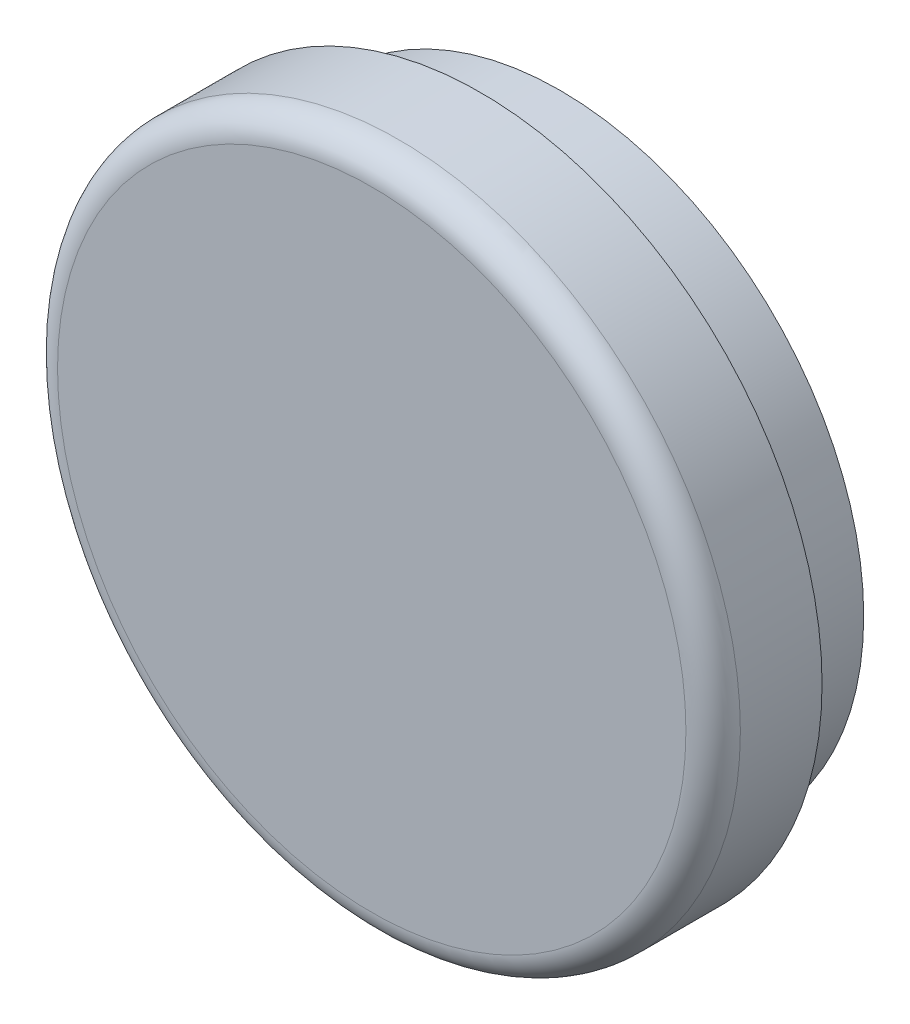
ISO-10303-21;
HEADER;
FILE_DESCRIPTION(('STEP AP214'),'2;1');
FILE_NAME('part.step','',(''),(''),'','','');
FILE_SCHEMA(('AUTOMOTIVE_DESIGN { 1 0 10303 214 1 1 1 1 }'));
ENDSEC;
DATA;
#1=APPLICATION_CONTEXT('core data for automotive mechanical design processes');
#2=APPLICATION_PROTOCOL_DEFINITION('international standard','automotive_design',2000,#1);
#3=PRODUCT_CONTEXT('',#1,'mechanical');
#4=PRODUCT('Part','Part','',(#3));
#5=PRODUCT_RELATED_PRODUCT_CATEGORY('part','',(#4));
#6=PRODUCT_DEFINITION_FORMATION('','',#4);
#7=PRODUCT_DEFINITION_CONTEXT('part definition',#1,'design');
#8=PRODUCT_DEFINITION('design','',#6,#7);
#9=PRODUCT_DEFINITION_SHAPE('','',#8);
#10=(LENGTH_UNIT() NAMED_UNIT(*) SI_UNIT(.MILLI.,.METRE.));
#11=(NAMED_UNIT(*) PLANE_ANGLE_UNIT() SI_UNIT($,.RADIAN.));
#12=(NAMED_UNIT(*) SI_UNIT($,.STERADIAN.) SOLID_ANGLE_UNIT());
#13=UNCERTAINTY_MEASURE_WITH_UNIT(LENGTH_MEASURE(1.E-05),#10,'distance_accuracy_value','');
#14=(GEOMETRIC_REPRESENTATION_CONTEXT(3) GLOBAL_UNCERTAINTY_ASSIGNED_CONTEXT((#13)) GLOBAL_UNIT_ASSIGNED_CONTEXT((#10,
#11,#12)) REPRESENTATION_CONTEXT('',''));
#15=CARTESIAN_POINT('',(0.,0.,0.));
#16=DIRECTION('',(0.,0.,1.));
#17=DIRECTION('',(1.,0.,0.));
#18=AXIS2_PLACEMENT_3D('',#15,#16,#17);
#19=CARTESIAN_POINT('',(79.629,0.,0.));
#20=DIRECTION('',(0.,0.,1.));
#21=DIRECTION('',(1.,0.,0.));
#22=AXIS2_PLACEMENT_3D('',#19,#20,#21);
#23=PLANE('',#22);
#24=CARTESIAN_POINT('',(0.,0.,0.));
#25=DIRECTION('',(0.,0.,1.));
#26=DIRECTION('',(1.,0.,0.));
#27=AXIS2_PLACEMENT_3D('',#24,#25,#26);
#28=CIRCLE('',#27,73.279);
#29=CARTESIAN_POINT('',(73.279,0.,0.));
#30=VERTEX_POINT('',#29);
#31=EDGE_CURVE('E37',#30,#30,#28,.T.);
#32=ORIENTED_EDGE('',*,*,#31,.T.);
#33=EDGE_LOOP('',(#32));
#34=FACE_BOUND('',#33,.T.);
#35=ADVANCED_FACE('F30',(#34),#23,.T.);
#36=CARTESIAN_POINT('',(0.,0.,-36.83));
#37=DIRECTION('',(0.,0.,-1.));
#38=DIRECTION('',(-1.,0.,0.));
#39=AXIS2_PLACEMENT_3D('',#36,#37,#38);
#40=PLANE('',#39);
#41=CARTESIAN_POINT('',(50.8,0.,-36.83));
#42=DIRECTION('',(0.,0.,-1.));
#43=DIRECTION('',(-1.,0.,0.));
#44=AXIS2_PLACEMENT_3D('',#41,#42,#43);
#45=CIRCLE('',#44,1.5875);
#46=CARTESIAN_POINT('',(49.2125,0.,-36.83));
#47=VERTEX_POINT('',#46);
#48=EDGE_CURVE('E78',#47,#47,#45,.T.);
#49=ORIENTED_EDGE('',*,*,#48,.F.);
#50=EDGE_LOOP('',(#49));
#51=FACE_BOUND('',#50,.T.);
#52=CARTESIAN_POINT('',(0.,-50.8,-36.83));
#53=DIRECTION('',(0.,0.,-1.));
#54=DIRECTION('',(-1.,0.,0.));
#55=AXIS2_PLACEMENT_3D('',#52,#53,#54);
#56=CIRCLE('',#55,1.5875);
#57=CARTESIAN_POINT('',(-1.58750000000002,-50.8,-36.83));
#58=VERTEX_POINT('',#57);
#59=EDGE_CURVE('E72',#58,#58,#56,.T.);
#60=ORIENTED_EDGE('',*,*,#59,.F.);
#61=EDGE_LOOP('',(#60));
#62=FACE_BOUND('',#61,.T.);
#63=CARTESIAN_POINT('',(-50.8,0.,-36.83));
#64=DIRECTION('',(0.,0.,-1.));
#65=DIRECTION('',(-1.,0.,0.));
#66=AXIS2_PLACEMENT_3D('',#63,#64,#65);
#67=CIRCLE('',#66,1.5875);
#68=CARTESIAN_POINT('',(-52.3875,0.,-36.83));
#69=VERTEX_POINT('',#68);
#70=EDGE_CURVE('E66',#69,#69,#67,.T.);
#71=ORIENTED_EDGE('',*,*,#70,.F.);
#72=EDGE_LOOP('',(#71));
#73=FACE_BOUND('',#72,.T.);
#74=CARTESIAN_POINT('',(0.,50.8,-36.83));
#75=DIRECTION('',(0.,0.,-1.));
#76=DIRECTION('',(-1.,0.,0.));
#77=AXIS2_PLACEMENT_3D('',#74,#75,#76);
#78=CIRCLE('',#77,1.5875);
#79=CARTESIAN_POINT('',(-1.5875,50.8,-36.83));
#80=VERTEX_POINT('',#79);
#81=EDGE_CURVE('E60',#80,#80,#78,.T.);
#82=ORIENTED_EDGE('',*,*,#81,.F.);
#83=EDGE_LOOP('',(#82));
#84=FACE_BOUND('',#83,.T.);
#85=CARTESIAN_POINT('',(0.,0.,-36.83));
#86=DIRECTION('',(0.,0.,1.));
#87=DIRECTION('',(1.,0.,0.));
#88=AXIS2_PLACEMENT_3D('',#85,#86,#87);
#89=CIRCLE('',#88,65.7225);
#90=CARTESIAN_POINT('',(65.7225,0.,-36.83));
#91=VERTEX_POINT('',#90);
#92=EDGE_CURVE('E41',#91,#91,#89,.T.);
#93=ORIENTED_EDGE('',*,*,#92,.F.);
#94=EDGE_LOOP('',(#93));
#95=FACE_BOUND('',#94,.T.);
#96=ADVANCED_FACE('F93',(#51,#62,#73,#84,#95),#40,.T.);
#97=CARTESIAN_POINT('',(0.,0.,0.));
#98=DIRECTION('',(0.,0.,1.));
#99=DIRECTION('',(1.,0.,0.));
#100=AXIS2_PLACEMENT_3D('',#97,#98,#99);
#101=CYLINDRICAL_SURFACE('',#100,65.7225);
#102=ORIENTED_EDGE('',*,*,#92,.T.);
#103=EDGE_LOOP('',(#102));
#104=FACE_BOUND('',#103,.T.);
#105=CARTESIAN_POINT('',(0.,0.,-41.275));
#106=DIRECTION('',(0.,0.,1.));
#107=DIRECTION('',(1.,0.,0.));
#108=AXIS2_PLACEMENT_3D('',#105,#106,#107);
#109=CIRCLE('',#108,65.7225);
#110=CARTESIAN_POINT('',(65.7225,0.,-41.275));
#111=VERTEX_POINT('',#110);
#112=EDGE_CURVE('E45',#111,#111,#109,.T.);
#113=ORIENTED_EDGE('',*,*,#112,.F.);
#114=EDGE_LOOP('',(#113));
#115=FACE_BOUND('',#114,.T.);
#116=ADVANCED_FACE('F96',(#104,#115),#101,.F.);
#117=CARTESIAN_POINT('',(0.,0.,-43.942));
#118=DIRECTION('',(0.,0.,-1.));
#119=DIRECTION('',(-1.,0.,0.));
#120=AXIS2_PLACEMENT_3D('',#117,#118,#119);
#121=CONICAL_SURFACE('',#120,70.8025,1.0873493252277);
#122=ORIENTED_EDGE('',*,*,#112,.T.);
#123=EDGE_LOOP('',(#122));
#124=FACE_BOUND('',#123,.T.);
#125=CARTESIAN_POINT('',(0.,0.,-43.942));
#126=DIRECTION('',(0.,0.,1.));
#127=DIRECTION('',(1.,0.,0.));
#128=AXIS2_PLACEMENT_3D('',#125,#126,#127);
#129=CIRCLE('',#128,70.8025);
#130=CARTESIAN_POINT('',(70.8025,0.,-43.942));
#131=VERTEX_POINT('',#130);
#132=EDGE_CURVE('E50',#131,#131,#129,.T.);
#133=ORIENTED_EDGE('',*,*,#132,.F.);
#134=EDGE_LOOP('',(#133));
#135=FACE_BOUND('',#134,.T.);
#136=ADVANCED_FACE('F108',(#124,#135),#121,.F.);
#137=CARTESIAN_POINT('',(0.,0.,0.));
#138=DIRECTION('',(0.,0.,1.));
#139=DIRECTION('',(1.,0.,0.));
#140=AXIS2_PLACEMENT_3D('',#137,#138,#139);
#141=CYLINDRICAL_SURFACE('',#140,70.8025);
#142=ORIENTED_EDGE('',*,*,#132,.T.);
#143=EDGE_LOOP('',(#142));
#144=FACE_BOUND('',#143,.T.);
#145=CARTESIAN_POINT('',(0.,0.,-25.4));
#146=DIRECTION('',(0.,0.,1.));
#147=DIRECTION('',(1.,0.,0.));
#148=AXIS2_PLACEMENT_3D('',#145,#146,#147);
#149=CIRCLE('',#148,70.8025);
#150=CARTESIAN_POINT('',(70.8025,0.,-25.4));
#151=VERTEX_POINT('',#150);
#152=EDGE_CURVE('E53',#151,#151,#149,.T.);
#153=ORIENTED_EDGE('',*,*,#152,.F.);
#154=EDGE_LOOP('',(#153));
#155=FACE_BOUND('',#154,.T.);
#156=ADVANCED_FACE('F114',(#144,#155),#141,.T.);
#157=CARTESIAN_POINT('',(70.8025,0.,-25.4));
#158=DIRECTION('',(0.,0.,-1.));
#159=DIRECTION('',(-1.,0.,0.));
#160=AXIS2_PLACEMENT_3D('',#157,#158,#159);
#161=PLANE('',#160);
#162=ORIENTED_EDGE('',*,*,#152,.T.);
#163=EDGE_LOOP('',(#162));
#164=FACE_BOUND('',#163,.T.);
#165=CARTESIAN_POINT('',(0.,0.,-25.4));
#166=DIRECTION('',(0.,0.,1.));
#167=DIRECTION('',(1.,0.,0.));
#168=AXIS2_PLACEMENT_3D('',#165,#166,#167);
#169=CIRCLE('',#168,79.629);
#170=CARTESIAN_POINT('',(79.629,0.,-25.4));
#171=VERTEX_POINT('',#170);
#172=EDGE_CURVE('E56',#171,#171,#169,.T.);
#173=ORIENTED_EDGE('',*,*,#172,.F.);
#174=EDGE_LOOP('',(#173));
#175=FACE_BOUND('',#174,.T.);
#176=ADVANCED_FACE('F120',(#164,#175),#161,.T.);
#177=CARTESIAN_POINT('',(0.,0.,0.));
#178=DIRECTION('',(0.,0.,1.));
#179=DIRECTION('',(1.,0.,0.));
#180=AXIS2_PLACEMENT_3D('',#177,#178,#179);
#181=CYLINDRICAL_SURFACE('',#180,79.629);
#182=CARTESIAN_POINT('',(0.,0.,-6.35));
#183=DIRECTION('',(0.,0.,1.));
#184=DIRECTION('',(1.,0.,0.));
#185=AXIS2_PLACEMENT_3D('',#182,#183,#184);
#186=CIRCLE('',#185,79.629);
#187=CARTESIAN_POINT('',(79.629,0.,-6.35));
#188=VERTEX_POINT('',#187);
#189=EDGE_CURVE('E10',#188,#188,#186,.F.);
#190=ORIENTED_EDGE('',*,*,#189,.T.);
#191=EDGE_LOOP('',(#190));
#192=FACE_BOUND('',#191,.T.);
#193=ORIENTED_EDGE('',*,*,#172,.T.);
#194=EDGE_LOOP('',(#193));
#195=FACE_BOUND('',#194,.T.);
#196=ADVANCED_FACE('F126',(#192,#195),#181,.T.);
#197=CARTESIAN_POINT('',(0.,0.,-6.35));
#198=DIRECTION('',(0.,0.,1.));
#199=DIRECTION('',(1.,0.,0.));
#200=AXIS2_PLACEMENT_3D('',#197,#198,#199);
#201=TOROIDAL_SURFACE('',#200,73.279,6.35);
#202=ORIENTED_EDGE('',*,*,#189,.F.);
#203=EDGE_LOOP('',(#202));
#204=FACE_BOUND('',#203,.T.);
#205=ORIENTED_EDGE('',*,*,#31,.F.);
#206=EDGE_LOOP('',(#205));
#207=FACE_BOUND('',#206,.T.);
#208=ADVANCED_FACE('F32',(#204,#207),#201,.T.);
#209=CARTESIAN_POINT('',(0.,50.8,-30.48));
#210=DIRECTION('',(0.,0.,-1.));
#211=DIRECTION('',(-1.,0.,0.));
#212=AXIS2_PLACEMENT_3D('',#209,#210,#211);
#213=CYLINDRICAL_SURFACE('',#212,1.5875);
#214=CARTESIAN_POINT('',(0.,50.8,-30.48));
#215=DIRECTION('',(0.,0.,-1.));
#216=DIRECTION('',(-1.,0.,0.));
#217=AXIS2_PLACEMENT_3D('',#214,#215,#216);
#218=CIRCLE('',#217,1.5875);
#219=CARTESIAN_POINT('',(-1.5875,50.8,-30.48));
#220=VERTEX_POINT('',#219);
#221=EDGE_CURVE('E59',#220,#220,#218,.T.);
#222=ORIENTED_EDGE('',*,*,#221,.F.);
#223=EDGE_LOOP('',(#222));
#224=FACE_BOUND('',#223,.T.);
#225=ORIENTED_EDGE('',*,*,#81,.T.);
#226=EDGE_LOOP('',(#225));
#227=FACE_BOUND('',#226,.T.);
#228=ADVANCED_FACE('F135',(#224,#227),#213,.F.);
#229=CARTESIAN_POINT('',(0.,50.8,-30.48));
#230=DIRECTION('',(0.,0.,-1.));
#231=DIRECTION('',(-1.,0.,0.));
#232=AXIS2_PLACEMENT_3D('',#229,#230,#231);
#233=PLANE('',#232);
#234=ORIENTED_EDGE('',*,*,#221,.T.);
#235=EDGE_LOOP('',(#234));
#236=FACE_BOUND('',#235,.T.);
#237=ADVANCED_FACE('F182',(#236),#233,.T.);
#238=CARTESIAN_POINT('',(-50.8,0.,-30.48));
#239=DIRECTION('',(0.,0.,-1.));
#240=DIRECTION('',(-1.,0.,0.));
#241=AXIS2_PLACEMENT_3D('',#238,#239,#240);
#242=CYLINDRICAL_SURFACE('',#241,1.5875);
#243=CARTESIAN_POINT('',(-50.8,0.,-30.48));
#244=DIRECTION('',(0.,0.,-1.));
#245=DIRECTION('',(-1.,0.,0.));
#246=AXIS2_PLACEMENT_3D('',#243,#244,#245);
#247=CIRCLE('',#246,1.5875);
#248=CARTESIAN_POINT('',(-52.3875,0.,-30.48));
#249=VERTEX_POINT('',#248);
#250=EDGE_CURVE('E63',#249,#249,#247,.T.);
#251=ORIENTED_EDGE('',*,*,#250,.F.);
#252=EDGE_LOOP('',(#251));
#253=FACE_BOUND('',#252,.T.);
#254=ORIENTED_EDGE('',*,*,#70,.T.);
#255=EDGE_LOOP('',(#254));
#256=FACE_BOUND('',#255,.T.);
#257=ADVANCED_FACE('F190',(#253,#256),#242,.F.);
#258=CARTESIAN_POINT('',(-50.8,0.,-30.48));
#259=DIRECTION('',(0.,0.,-1.));
#260=DIRECTION('',(-1.,0.,0.));
#261=AXIS2_PLACEMENT_3D('',#258,#259,#260);
#262=PLANE('',#261);
#263=ORIENTED_EDGE('',*,*,#250,.T.);
#264=EDGE_LOOP('',(#263));
#265=FACE_BOUND('',#264,.T.);
#266=ADVANCED_FACE('F199',(#265),#262,.T.);
#267=CARTESIAN_POINT('',(0.,-50.8,-30.48));
#268=DIRECTION('',(0.,0.,-1.));
#269=DIRECTION('',(-1.,0.,0.));
#270=AXIS2_PLACEMENT_3D('',#267,#268,#269);
#271=CYLINDRICAL_SURFACE('',#270,1.5875);
#272=CARTESIAN_POINT('',(0.,-50.8,-30.48));
#273=DIRECTION('',(0.,0.,-1.));
#274=DIRECTION('',(-1.,0.,0.));
#275=AXIS2_PLACEMENT_3D('',#272,#273,#274);
#276=CIRCLE('',#275,1.5875);
#277=CARTESIAN_POINT('',(-1.58750000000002,-50.8,-30.48));
#278=VERTEX_POINT('',#277);
#279=EDGE_CURVE('E69',#278,#278,#276,.T.);
#280=ORIENTED_EDGE('',*,*,#279,.F.);
#281=EDGE_LOOP('',(#280));
#282=FACE_BOUND('',#281,.T.);
#283=ORIENTED_EDGE('',*,*,#59,.T.);
#284=EDGE_LOOP('',(#283));
#285=FACE_BOUND('',#284,.T.);
#286=ADVANCED_FACE('F208',(#282,#285),#271,.F.);
#287=CARTESIAN_POINT('',(0.,-50.8,-30.48));
#288=DIRECTION('',(0.,0.,-1.));
#289=DIRECTION('',(-1.,0.,0.));
#290=AXIS2_PLACEMENT_3D('',#287,#288,#289);
#291=PLANE('',#290);
#292=ORIENTED_EDGE('',*,*,#279,.T.);
#293=EDGE_LOOP('',(#292));
#294=FACE_BOUND('',#293,.T.);
#295=ADVANCED_FACE('F89',(#294),#291,.T.);
#296=CARTESIAN_POINT('',(50.8,0.,-30.48));
#297=DIRECTION('',(0.,0.,-1.));
#298=DIRECTION('',(-1.,0.,0.));
#299=AXIS2_PLACEMENT_3D('',#296,#297,#298);
#300=CYLINDRICAL_SURFACE('',#299,1.5875);
#301=CARTESIAN_POINT('',(50.8,0.,-30.48));
#302=DIRECTION('',(0.,0.,-1.));
#303=DIRECTION('',(-1.,0.,0.));
#304=AXIS2_PLACEMENT_3D('',#301,#302,#303);
#305=CIRCLE('',#304,1.5875);
#306=CARTESIAN_POINT('',(49.2125,0.,-30.48));
#307=VERTEX_POINT('',#306);
#308=EDGE_CURVE('E75',#307,#307,#305,.T.);
#309=ORIENTED_EDGE('',*,*,#308,.F.);
#310=EDGE_LOOP('',(#309));
#311=FACE_BOUND('',#310,.T.);
#312=ORIENTED_EDGE('',*,*,#48,.T.);
#313=EDGE_LOOP('',(#312));
#314=FACE_BOUND('',#313,.T.);
#315=ADVANCED_FACE('F86',(#311,#314),#300,.F.);
#316=CARTESIAN_POINT('',(50.8,0.,-30.48));
#317=DIRECTION('',(0.,0.,-1.));
#318=DIRECTION('',(-1.,0.,0.));
#319=AXIS2_PLACEMENT_3D('',#316,#317,#318);
#320=PLANE('',#319);
#321=ORIENTED_EDGE('',*,*,#308,.T.);
#322=EDGE_LOOP('',(#321));
#323=FACE_BOUND('',#322,.T.);
#324=ADVANCED_FACE('F84',(#323),#320,.T.);
#325=CLOSED_SHELL('',(#35,#96,#116,#136,#156,#176,#196,#208,#228,#237,#257,#266,#286,#295,#315,#324));
#326=MANIFOLD_SOLID_BREP('B2',#325);
#327=ADVANCED_BREP_SHAPE_REPRESENTATION('',(#18,#326),#14);
#328=SHAPE_DEFINITION_REPRESENTATION(#9,#327);
ENDSEC;
END-ISO-10303-21;
